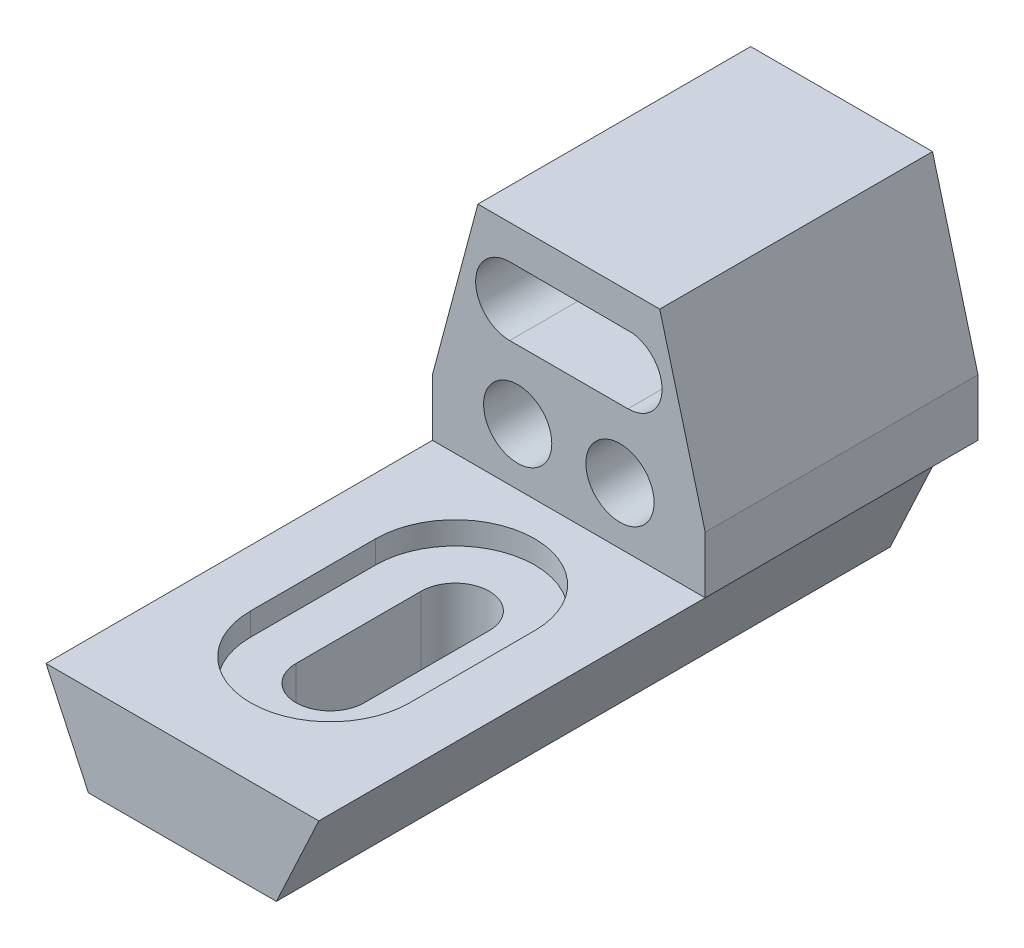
ISO-10303-21;
HEADER;
FILE_DESCRIPTION(('STEP AP214'),'2;1');
FILE_NAME('part.step','',(''),(''),'','','');
FILE_SCHEMA(('AUTOMOTIVE_DESIGN { 1 0 10303 214 1 1 1 1 }'));
ENDSEC;
DATA;
#1=APPLICATION_CONTEXT('core data for automotive mechanical design processes');
#2=APPLICATION_PROTOCOL_DEFINITION('international standard','automotive_design',2000,#1);
#3=PRODUCT_CONTEXT('',#1,'mechanical');
#4=PRODUCT('Part','Part','',(#3));
#5=PRODUCT_RELATED_PRODUCT_CATEGORY('part','',(#4));
#6=PRODUCT_DEFINITION_FORMATION('','',#4);
#7=PRODUCT_DEFINITION_CONTEXT('part definition',#1,'design');
#8=PRODUCT_DEFINITION('design','',#6,#7);
#9=PRODUCT_DEFINITION_SHAPE('','',#8);
#10=(LENGTH_UNIT() NAMED_UNIT(*) SI_UNIT(.MILLI.,.METRE.));
#11=(NAMED_UNIT(*) PLANE_ANGLE_UNIT() SI_UNIT($,.RADIAN.));
#12=(NAMED_UNIT(*) SI_UNIT($,.STERADIAN.) SOLID_ANGLE_UNIT());
#13=UNCERTAINTY_MEASURE_WITH_UNIT(LENGTH_MEASURE(1.E-05),#10,'distance_accuracy_value','');
#14=(GEOMETRIC_REPRESENTATION_CONTEXT(3) GLOBAL_UNCERTAINTY_ASSIGNED_CONTEXT((#13)) GLOBAL_UNIT_ASSIGNED_CONTEXT((#10,
#11,#12)) REPRESENTATION_CONTEXT('',''));
#15=CARTESIAN_POINT('',(0.,0.,0.));
#16=DIRECTION('',(0.,0.,1.));
#17=DIRECTION('',(1.,0.,0.));
#18=AXIS2_PLACEMENT_3D('',#15,#16,#17);
#19=CARTESIAN_POINT('',(0.,0.,-7366.));
#20=DIRECTION('',(0.,0.,1.));
#21=DIRECTION('',(1.,0.,0.));
#22=AXIS2_PLACEMENT_3D('',#19,#20,#21);
#23=PLANE('',#22);
#24=CARTESIAN_POINT('',(2095.5,635.,-7366.));
#25=DIRECTION('',(0.,0.,1.));
#26=DIRECTION('',(1.,0.,0.));
#27=AXIS2_PLACEMENT_3D('',#24,#25,#26);
#28=CIRCLE('',#27,381.);
#29=CARTESIAN_POINT('',(2476.5,635.,-7366.));
#30=VERTEX_POINT('',#29);
#31=EDGE_CURVE('E511',#30,#30,#28,.F.);
#32=ORIENTED_EDGE('',*,*,#31,.F.);
#33=EDGE_LOOP('',(#32));
#34=FACE_BOUND('',#33,.T.);
#35=CARTESIAN_POINT('',(952.5,635.,-7366.));
#36=DIRECTION('',(0.,0.,1.));
#37=DIRECTION('',(1.,0.,0.));
#38=AXIS2_PLACEMENT_3D('',#35,#36,#37);
#39=CIRCLE('',#38,381.);
#40=CARTESIAN_POINT('',(1333.5,635.,-7366.));
#41=VERTEX_POINT('',#40);
#42=EDGE_CURVE('E505',#41,#41,#39,.T.);
#43=ORIENTED_EDGE('',*,*,#42,.T.);
#44=EDGE_LOOP('',(#43));
#45=FACE_BOUND('',#44,.T.);
#46=DIRECTION('',(1.,0.,0.));
#47=VECTOR('',#46,1.);
#48=CARTESIAN_POINT('',(0.,0.,-7366.));
#49=LINE('',#48,#47);
#50=CARTESIAN_POINT('',(0.,0.,-7366.));
#51=VERTEX_POINT('',#50);
#52=CARTESIAN_POINT('',(3048.,0.,-7366.));
#53=VERTEX_POINT('',#52);
#54=EDGE_CURVE('E221',#51,#53,#49,.T.);
#55=ORIENTED_EDGE('',*,*,#54,.F.);
#56=DIRECTION('',(0.,-1.,0.));
#57=VECTOR('',#56,1.);
#58=CARTESIAN_POINT('',(0.,0.,-7366.));
#59=LINE('',#58,#57);
#60=CARTESIAN_POINT('',(0.,635.,-7366.));
#61=VERTEX_POINT('',#60);
#62=EDGE_CURVE('E289',#61,#51,#59,.T.);
#63=ORIENTED_EDGE('',*,*,#62,.F.);
#64=DIRECTION('',(-0.257662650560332,-0.966234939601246,0.));
#65=VECTOR('',#64,1.);
#66=CARTESIAN_POINT('',(0.,635.,-7366.));
#67=LINE('',#66,#65);
#68=CARTESIAN_POINT('',(508.,2540.,-7366.));
#69=VERTEX_POINT('',#68);
#70=EDGE_CURVE('E478',#69,#61,#67,.T.);
#71=ORIENTED_EDGE('',*,*,#70,.F.);
#72=DIRECTION('',(-1.,0.,0.));
#73=VECTOR('',#72,1.);
#74=CARTESIAN_POINT('',(1524.,2540.,-7366.));
#75=LINE('',#74,#73);
#76=CARTESIAN_POINT('',(2540.,2540.,-7366.));
#77=VERTEX_POINT('',#76);
#78=EDGE_CURVE('E473',#77,#69,#75,.T.);
#79=ORIENTED_EDGE('',*,*,#78,.F.);
#80=DIRECTION('',(-0.257662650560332,0.966234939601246,0.));
#81=VECTOR('',#80,1.);
#82=CARTESIAN_POINT('',(2540.,2540.,-7366.));
#83=LINE('',#82,#81);
#84=CARTESIAN_POINT('',(3048.,635.,-7366.));
#85=VERTEX_POINT('',#84);
#86=EDGE_CURVE('E471',#85,#77,#83,.T.);
#87=ORIENTED_EDGE('',*,*,#86,.F.);
#88=DIRECTION('',(0.,1.,0.));
#89=VECTOR('',#88,1.);
#90=CARTESIAN_POINT('',(3048.,0.,-7366.));
#91=LINE('',#90,#89);
#92=EDGE_CURVE('E224',#53,#85,#91,.T.);
#93=ORIENTED_EDGE('',*,*,#92,.F.);
#94=EDGE_LOOP('',(#55,#63,#71,#79,#87,#93));
#95=FACE_BOUND('',#94,.T.);
#96=CARTESIAN_POINT('',(863.6,1778.,-7366.));
#97=DIRECTION('',(0.,0.,1.));
#98=DIRECTION('',(1.,0.,0.));
#99=AXIS2_PLACEMENT_3D('',#96,#97,#98);
#100=CIRCLE('',#99,381.);
#101=CARTESIAN_POINT('',(863.6,1397.,-7366.));
#102=VERTEX_POINT('',#101);
#103=CARTESIAN_POINT('',(863.59999999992,2159.,-7366.));
#104=VERTEX_POINT('',#103);
#105=EDGE_CURVE('E37',#102,#104,#100,.F.);
#106=ORIENTED_EDGE('',*,*,#105,.F.);
#107=DIRECTION('',(1.,0.,0.));
#108=VECTOR('',#107,1.);
#109=CARTESIAN_POINT('',(0.,1397.,-7366.));
#110=LINE('',#109,#108);
#111=CARTESIAN_POINT('',(2184.4,1397.,-7366.));
#112=VERTEX_POINT('',#111);
#113=EDGE_CURVE('E487',#102,#112,#110,.T.);
#114=ORIENTED_EDGE('',*,*,#113,.T.);
#115=CARTESIAN_POINT('',(2184.4,1778.,-7366.));
#116=DIRECTION('',(0.,0.,1.));
#117=DIRECTION('',(1.,0.,0.));
#118=AXIS2_PLACEMENT_3D('',#115,#116,#117);
#119=CIRCLE('',#118,381.);
#120=CARTESIAN_POINT('',(2240.32346850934,2154.87340801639,-7366.));
#121=VERTEX_POINT('',#120);
#122=EDGE_CURVE('E52',#112,#121,#119,.T.);
#123=ORIENTED_EDGE('',*,*,#122,.T.);
#124=DIRECTION('',(0.999995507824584,-0.00299738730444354,0.));
#125=VECTOR('',#124,1.);
#126=CARTESIAN_POINT('',(6.47908898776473,2161.56913487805,-7366.));
#127=LINE('',#126,#125);
#128=EDGE_CURVE('E548',#104,#121,#127,.T.);
#129=ORIENTED_EDGE('',*,*,#128,.F.);
#130=EDGE_LOOP('',(#106,#114,#123,#129));
#131=FACE_BOUND('',#130,.T.);
#132=ADVANCED_FACE('F33',(#34,#45,#95,#131),#23,.F.);
#133=CARTESIAN_POINT('',(0.,0.,-4318.));
#134=DIRECTION('',(0.,0.,1.));
#135=DIRECTION('',(1.,0.,0.));
#136=AXIS2_PLACEMENT_3D('',#133,#134,#135);
#137=PLANE('',#136);
#138=CARTESIAN_POINT('',(2095.5,635.,-4318.));
#139=DIRECTION('',(0.,0.,1.));
#140=DIRECTION('',(1.,0.,0.));
#141=AXIS2_PLACEMENT_3D('',#138,#139,#140);
#142=CIRCLE('',#141,381.);
#143=CARTESIAN_POINT('',(2476.5,635.,-4318.));
#144=VERTEX_POINT('',#143);
#145=EDGE_CURVE('E514',#144,#144,#142,.F.);
#146=ORIENTED_EDGE('',*,*,#145,.T.);
#147=EDGE_LOOP('',(#146));
#148=FACE_BOUND('',#147,.T.);
#149=CARTESIAN_POINT('',(952.5,635.,-4318.));
#150=DIRECTION('',(0.,0.,1.));
#151=DIRECTION('',(1.,0.,0.));
#152=AXIS2_PLACEMENT_3D('',#149,#150,#151);
#153=CIRCLE('',#152,381.);
#154=CARTESIAN_POINT('',(1333.5,635.,-4318.));
#155=VERTEX_POINT('',#154);
#156=EDGE_CURVE('E508',#155,#155,#153,.T.);
#157=ORIENTED_EDGE('',*,*,#156,.F.);
#158=EDGE_LOOP('',(#157));
#159=FACE_BOUND('',#158,.T.);
#160=DIRECTION('',(1.,0.,0.));
#161=VECTOR('',#160,1.);
#162=CARTESIAN_POINT('',(0.,0.,-4318.));
#163=LINE('',#162,#161);
#164=CARTESIAN_POINT('',(0.,0.,-4318.));
#165=VERTEX_POINT('',#164);
#166=CARTESIAN_POINT('',(3048.,0.,-4318.));
#167=VERTEX_POINT('',#166);
#168=EDGE_CURVE('E187',#165,#167,#163,.T.);
#169=ORIENTED_EDGE('',*,*,#168,.T.);
#170=DIRECTION('',(0.,1.,0.));
#171=VECTOR('',#170,1.);
#172=CARTESIAN_POINT('',(3048.,0.,-4318.));
#173=LINE('',#172,#171);
#174=CARTESIAN_POINT('',(3048.,635.,-4318.));
#175=VERTEX_POINT('',#174);
#176=EDGE_CURVE('E198',#167,#175,#173,.T.);
#177=ORIENTED_EDGE('',*,*,#176,.T.);
#178=DIRECTION('',(-0.257662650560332,0.966234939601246,0.));
#179=VECTOR('',#178,1.);
#180=CARTESIAN_POINT('',(2540.,2540.,-4318.));
#181=LINE('',#180,#179);
#182=CARTESIAN_POINT('',(2540.,2540.,-4318.));
#183=VERTEX_POINT('',#182);
#184=EDGE_CURVE('E266',#175,#183,#181,.T.);
#185=ORIENTED_EDGE('',*,*,#184,.T.);
#186=DIRECTION('',(-1.,0.,0.));
#187=VECTOR('',#186,1.);
#188=CARTESIAN_POINT('',(1524.,2540.,-4318.));
#189=LINE('',#188,#187);
#190=CARTESIAN_POINT('',(508.,2540.,-4318.));
#191=VERTEX_POINT('',#190);
#192=EDGE_CURVE('E226',#183,#191,#189,.T.);
#193=ORIENTED_EDGE('',*,*,#192,.T.);
#194=DIRECTION('',(-0.257662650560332,-0.966234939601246,0.));
#195=VECTOR('',#194,1.);
#196=CARTESIAN_POINT('',(0.,635.,-4318.));
#197=LINE('',#196,#195);
#198=CARTESIAN_POINT('',(0.,635.,-4318.));
#199=VERTEX_POINT('',#198);
#200=EDGE_CURVE('E220',#191,#199,#197,.T.);
#201=ORIENTED_EDGE('',*,*,#200,.T.);
#202=DIRECTION('',(0.,-1.,0.));
#203=VECTOR('',#202,1.);
#204=CARTESIAN_POINT('',(0.,0.,-4318.));
#205=LINE('',#204,#203);
#206=EDGE_CURVE('E212',#199,#165,#205,.T.);
#207=ORIENTED_EDGE('',*,*,#206,.T.);
#208=EDGE_LOOP('',(#169,#177,#185,#193,#201,#207));
#209=FACE_BOUND('',#208,.T.);
#210=DIRECTION('',(1.,0.,0.));
#211=VECTOR('',#210,1.);
#212=CARTESIAN_POINT('',(0.,1397.,-4318.));
#213=LINE('',#212,#211);
#214=CARTESIAN_POINT('',(863.6,1397.,-4318.));
#215=VERTEX_POINT('',#214);
#216=CARTESIAN_POINT('',(2184.4,1397.,-4318.));
#217=VERTEX_POINT('',#216);
#218=EDGE_CURVE('E499',#215,#217,#213,.T.);
#219=ORIENTED_EDGE('',*,*,#218,.F.);
#220=CARTESIAN_POINT('',(863.6,1778.,-4318.));
#221=DIRECTION('',(0.,0.,1.));
#222=DIRECTION('',(1.,0.,0.));
#223=AXIS2_PLACEMENT_3D('',#220,#221,#222);
#224=CIRCLE('',#223,381.);
#225=CARTESIAN_POINT('',(863.6,2159.,-4318.));
#226=VERTEX_POINT('',#225);
#227=EDGE_CURVE('E502',#215,#226,#224,.F.);
#228=ORIENTED_EDGE('',*,*,#227,.T.);
#229=DIRECTION('',(0.999995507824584,-0.00299738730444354,0.));
#230=VECTOR('',#229,1.);
#231=CARTESIAN_POINT('',(6.47908898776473,2161.56913487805,-4318.));
#232=LINE('',#231,#230);
#233=CARTESIAN_POINT('',(2240.32346850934,2154.87340801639,-4318.));
#234=VERTEX_POINT('',#233);
#235=EDGE_CURVE('E492',#226,#234,#232,.T.);
#236=ORIENTED_EDGE('',*,*,#235,.T.);
#237=CARTESIAN_POINT('',(2184.4,1778.,-4318.));
#238=DIRECTION('',(0.,0.,1.));
#239=DIRECTION('',(1.,0.,0.));
#240=AXIS2_PLACEMENT_3D('',#237,#238,#239);
#241=CIRCLE('',#240,381.);
#242=EDGE_CURVE('E496',#217,#234,#241,.T.);
#243=ORIENTED_EDGE('',*,*,#242,.F.);
#244=EDGE_LOOP('',(#219,#228,#236,#243));
#245=FACE_BOUND('',#244,.T.);
#246=ADVANCED_FACE('F216',(#148,#159,#209,#245),#137,.T.);
#247=CARTESIAN_POINT('',(473.768580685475,-1016.,-6858.));
#248=DIRECTION('',(-0.906307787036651,-0.422618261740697,0.));
#249=DIRECTION('',(0.422618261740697,-0.906307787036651,0.));
#250=AXIS2_PLACEMENT_3D('',#247,#248,#249);
#251=PLANE('',#250);
#252=DIRECTION('',(0.422618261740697,-0.906307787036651,0.));
#253=VECTOR('',#252,1.);
#254=CARTESIAN_POINT('',(473.768580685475,-1016.,0.));
#255=LINE('',#254,#253);
#256=CARTESIAN_POINT('',(0.,0.,0.));
#257=VERTEX_POINT('',#256);
#258=CARTESIAN_POINT('',(473.768580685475,-1016.,0.));
#259=VERTEX_POINT('',#258);
#260=EDGE_CURVE('E204',#257,#259,#255,.T.);
#261=ORIENTED_EDGE('',*,*,#260,.F.);
#262=DIRECTION('',(0.,0.,1.));
#263=VECTOR('',#262,1.);
#264=CARTESIAN_POINT('',(0.,0.,-6858.));
#265=LINE('',#264,#263);
#266=EDGE_CURVE('E43',#165,#257,#265,.T.);
#267=ORIENTED_EDGE('',*,*,#266,.F.);
#268=CARTESIAN_POINT('',(0.,0.,-6858.));
#269=VERTEX_POINT('',#268);
#270=EDGE_CURVE('E11',#269,#165,#265,.T.);
#271=ORIENTED_EDGE('',*,*,#270,.F.);
#272=DIRECTION('',(0.422618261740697,-0.906307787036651,0.));
#273=VECTOR('',#272,1.);
#274=CARTESIAN_POINT('',(473.768580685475,-1016.,-6858.));
#275=LINE('',#274,#273);
#276=CARTESIAN_POINT('',(473.768580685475,-1016.,-6858.));
#277=VERTEX_POINT('',#276);
#278=EDGE_CURVE('E233',#269,#277,#275,.T.);
#279=ORIENTED_EDGE('',*,*,#278,.T.);
#280=DIRECTION('',(0.,0.,1.));
#281=VECTOR('',#280,1.);
#282=CARTESIAN_POINT('',(473.768580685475,-1016.,-6858.));
#283=LINE('',#282,#281);
#284=EDGE_CURVE('E243',#277,#259,#283,.T.);
#285=ORIENTED_EDGE('',*,*,#284,.T.);
#286=EDGE_LOOP('',(#261,#267,#271,#279,#285));
#287=FACE_BOUND('',#286,.T.);
#288=ADVANCED_FACE('F35',(#287),#251,.T.);
#289=CARTESIAN_POINT('',(0.,0.,-6858.));
#290=DIRECTION('',(0.,1.,0.));
#291=DIRECTION('',(0.,0.,1.));
#292=AXIS2_PLACEMENT_3D('',#289,#290,#291);
#293=PLANE('',#292);
#294=ORIENTED_EDGE('',*,*,#168,.F.);
#295=ORIENTED_EDGE('',*,*,#266,.T.);
#296=DIRECTION('',(-1.,0.,0.));
#297=VECTOR('',#296,1.);
#298=CARTESIAN_POINT('',(0.,0.,0.));
#299=LINE('',#298,#297);
#300=CARTESIAN_POINT('',(3048.,0.,0.));
#301=VERTEX_POINT('',#300);
#302=EDGE_CURVE('E236',#301,#257,#299,.T.);
#303=ORIENTED_EDGE('',*,*,#302,.F.);
#304=DIRECTION('',(0.,0.,1.));
#305=VECTOR('',#304,1.);
#306=CARTESIAN_POINT('',(3048.,0.,-6858.));
#307=LINE('',#306,#305);
#308=EDGE_CURVE('E193',#167,#301,#307,.T.);
#309=ORIENTED_EDGE('',*,*,#308,.F.);
#310=EDGE_LOOP('',(#294,#295,#303,#309));
#311=FACE_BOUND('',#310,.T.);
#312=CARTESIAN_POINT('',(1524.,0.,-3048.));
#313=DIRECTION('',(0.,1.,0.));
#314=DIRECTION('',(0.,0.,1.));
#315=AXIS2_PLACEMENT_3D('',#312,#313,#314);
#316=CIRCLE('',#315,889.000000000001);
#317=CARTESIAN_POINT('',(2413.,0.,-3048.));
#318=VERTEX_POINT('',#317);
#319=CARTESIAN_POINT('',(634.999999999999,0.,-3048.));
#320=VERTEX_POINT('',#319);
#321=EDGE_CURVE('E315',#318,#320,#316,.T.);
#322=ORIENTED_EDGE('',*,*,#321,.F.);
#323=DIRECTION('',(0.,0.,-1.));
#324=VECTOR('',#323,1.);
#325=CARTESIAN_POINT('',(2413.,0.,-3048.));
#326=LINE('',#325,#324);
#327=CARTESIAN_POINT('',(2413.,0.,-1651.));
#328=VERTEX_POINT('',#327);
#329=EDGE_CURVE('E326',#328,#318,#326,.T.);
#330=ORIENTED_EDGE('',*,*,#329,.F.);
#331=CARTESIAN_POINT('',(1524.,0.,-1651.));
#332=DIRECTION('',(0.,1.,0.));
#333=DIRECTION('',(0.,0.,1.));
#334=AXIS2_PLACEMENT_3D('',#331,#332,#333);
#335=CIRCLE('',#334,889.000000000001);
#336=CARTESIAN_POINT('',(634.999999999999,0.,-1651.));
#337=VERTEX_POINT('',#336);
#338=EDGE_CURVE('E340',#337,#328,#335,.T.);
#339=ORIENTED_EDGE('',*,*,#338,.F.);
#340=DIRECTION('',(0.,0.,1.));
#341=VECTOR('',#340,1.);
#342=CARTESIAN_POINT('',(634.999999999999,0.,-3048.));
#343=LINE('',#342,#341);
#344=EDGE_CURVE('E337',#320,#337,#343,.T.);
#345=ORIENTED_EDGE('',*,*,#344,.F.);
#346=EDGE_LOOP('',(#322,#330,#339,#345));
#347=FACE_BOUND('',#346,.T.);
#348=ADVANCED_FACE('F189',(#311,#347),#293,.T.);
#349=CARTESIAN_POINT('',(3048.,0.,-6858.));
#350=DIRECTION('',(0.906307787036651,-0.422618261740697,0.));
#351=DIRECTION('',(0.422618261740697,0.906307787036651,0.));
#352=AXIS2_PLACEMENT_3D('',#349,#350,#351);
#353=PLANE('',#352);
#354=DIRECTION('',(0.422618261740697,0.906307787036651,0.));
#355=VECTOR('',#354,1.);
#356=CARTESIAN_POINT('',(3048.,0.,0.));
#357=LINE('',#356,#355);
#358=CARTESIAN_POINT('',(2574.23141931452,-1016.,0.));
#359=VERTEX_POINT('',#358);
#360=EDGE_CURVE('E255',#359,#301,#357,.T.);
#361=ORIENTED_EDGE('',*,*,#360,.F.);
#362=DIRECTION('',(0.,0.,1.));
#363=VECTOR('',#362,1.);
#364=CARTESIAN_POINT('',(2574.23141931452,-1016.,-6858.));
#365=LINE('',#364,#363);
#366=CARTESIAN_POINT('',(2574.23141931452,-1016.,-6858.));
#367=VERTEX_POINT('',#366);
#368=EDGE_CURVE('E452',#367,#359,#365,.T.);
#369=ORIENTED_EDGE('',*,*,#368,.F.);
#370=DIRECTION('',(0.422618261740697,0.906307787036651,0.));
#371=VECTOR('',#370,1.);
#372=CARTESIAN_POINT('',(3048.,0.,-6858.));
#373=LINE('',#372,#371);
#374=CARTESIAN_POINT('',(3048.,0.,-6858.));
#375=VERTEX_POINT('',#374);
#376=EDGE_CURVE('E244',#367,#375,#373,.T.);
#377=ORIENTED_EDGE('',*,*,#376,.T.);
#378=EDGE_CURVE('E206',#375,#167,#307,.T.);
#379=ORIENTED_EDGE('',*,*,#378,.T.);
#380=ORIENTED_EDGE('',*,*,#308,.T.);
#381=EDGE_LOOP('',(#361,#369,#377,#379,#380));
#382=FACE_BOUND('',#381,.T.);
#383=ADVANCED_FACE('F448',(#382),#353,.T.);
#384=CARTESIAN_POINT('',(2574.23141931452,-1016.,-6858.));
#385=DIRECTION('',(0.,-1.,0.));
#386=DIRECTION('',(1.,0.,0.));
#387=AXIS2_PLACEMENT_3D('',#384,#385,#386);
#388=PLANE('',#387);
#389=CARTESIAN_POINT('',(1524.,-1016.,-3048.));
#390=DIRECTION('',(0.,1.,0.));
#391=DIRECTION('',(0.,0.,1.));
#392=AXIS2_PLACEMENT_3D('',#389,#390,#391);
#393=CIRCLE('',#392,381.);
#394=CARTESIAN_POINT('',(1905.,-1016.,-3048.));
#395=VERTEX_POINT('',#394);
#396=CARTESIAN_POINT('',(1143.,-1016.,-3048.));
#397=VERTEX_POINT('',#396);
#398=EDGE_CURVE('E290',#395,#397,#393,.T.);
#399=ORIENTED_EDGE('',*,*,#398,.T.);
#400=DIRECTION('',(0.,0.,1.));
#401=VECTOR('',#400,1.);
#402=CARTESIAN_POINT('',(1143.,-1016.,-3048.));
#403=LINE('',#402,#401);
#404=CARTESIAN_POINT('',(1143.,-1016.,-1651.));
#405=VERTEX_POINT('',#404);
#406=EDGE_CURVE('E293',#397,#405,#403,.T.);
#407=ORIENTED_EDGE('',*,*,#406,.T.);
#408=CARTESIAN_POINT('',(1524.,-1016.,-1651.));
#409=DIRECTION('',(0.,1.,0.));
#410=DIRECTION('',(0.,0.,1.));
#411=AXIS2_PLACEMENT_3D('',#408,#409,#410);
#412=CIRCLE('',#411,381.);
#413=CARTESIAN_POINT('',(1905.,-1016.,-1651.));
#414=VERTEX_POINT('',#413);
#415=EDGE_CURVE('E297',#405,#414,#412,.T.);
#416=ORIENTED_EDGE('',*,*,#415,.T.);
#417=DIRECTION('',(0.,0.,-1.));
#418=VECTOR('',#417,1.);
#419=CARTESIAN_POINT('',(1905.,-1016.,-3048.));
#420=LINE('',#419,#418);
#421=EDGE_CURVE('E300',#414,#395,#420,.T.);
#422=ORIENTED_EDGE('',*,*,#421,.T.);
#423=EDGE_LOOP('',(#399,#407,#416,#422));
#424=FACE_BOUND('',#423,.T.);
#425=DIRECTION('',(1.,0.,0.));
#426=VECTOR('',#425,1.);
#427=CARTESIAN_POINT('',(2574.23141931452,-1016.,0.));
#428=LINE('',#427,#426);
#429=EDGE_CURVE('E251',#259,#359,#428,.T.);
#430=ORIENTED_EDGE('',*,*,#429,.F.);
#431=ORIENTED_EDGE('',*,*,#284,.F.);
#432=DIRECTION('',(1.,0.,0.));
#433=VECTOR('',#432,1.);
#434=CARTESIAN_POINT('',(2574.23141931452,-1016.,-6858.));
#435=LINE('',#434,#433);
#436=EDGE_CURVE('E235',#277,#367,#435,.T.);
#437=ORIENTED_EDGE('',*,*,#436,.T.);
#438=ORIENTED_EDGE('',*,*,#368,.T.);
#439=EDGE_LOOP('',(#430,#431,#437,#438));
#440=FACE_BOUND('',#439,.T.);
#441=ADVANCED_FACE('F443',(#424,#440),#388,.T.);
#442=CARTESIAN_POINT('',(0.,0.,-6858.));
#443=DIRECTION('',(0.,0.,-1.));
#444=DIRECTION('',(-1.,0.,0.));
#445=AXIS2_PLACEMENT_3D('',#442,#443,#444);
#446=PLANE('',#445);
#447=ORIENTED_EDGE('',*,*,#278,.F.);
#448=DIRECTION('',(-1.,0.,0.));
#449=VECTOR('',#448,1.);
#450=CARTESIAN_POINT('',(0.,0.,-6858.));
#451=LINE('',#450,#449);
#452=EDGE_CURVE('E239',#375,#269,#451,.T.);
#453=ORIENTED_EDGE('',*,*,#452,.F.);
#454=ORIENTED_EDGE('',*,*,#376,.F.);
#455=ORIENTED_EDGE('',*,*,#436,.F.);
#456=EDGE_LOOP('',(#447,#453,#454,#455));
#457=FACE_BOUND('',#456,.T.);
#458=ADVANCED_FACE('F447',(#457),#446,.T.);
#459=CARTESIAN_POINT('',(0.,0.,0.));
#460=DIRECTION('',(0.,0.,-1.));
#461=DIRECTION('',(-1.,0.,0.));
#462=AXIS2_PLACEMENT_3D('',#459,#460,#461);
#463=PLANE('',#462);
#464=ORIENTED_EDGE('',*,*,#260,.T.);
#465=ORIENTED_EDGE('',*,*,#429,.T.);
#466=ORIENTED_EDGE('',*,*,#360,.T.);
#467=ORIENTED_EDGE('',*,*,#302,.T.);
#468=EDGE_LOOP('',(#464,#465,#466,#467));
#469=FACE_BOUND('',#468,.T.);
#470=ADVANCED_FACE('F375',(#469),#463,.F.);
#471=CARTESIAN_POINT('',(1524.,-254.,-3048.));
#472=DIRECTION('',(0.,1.,0.));
#473=DIRECTION('',(0.,0.,1.));
#474=AXIS2_PLACEMENT_3D('',#471,#472,#473);
#475=CYLINDRICAL_SURFACE('',#474,889.000000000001);
#476=ORIENTED_EDGE('',*,*,#321,.T.);
#477=DIRECTION('',(0.,1.,0.));
#478=VECTOR('',#477,1.);
#479=CARTESIAN_POINT('',(634.999999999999,-254.,-3048.));
#480=LINE('',#479,#478);
#481=CARTESIAN_POINT('',(634.999999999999,-254.,-3048.));
#482=VERTEX_POINT('',#481);
#483=EDGE_CURVE('E335',#482,#320,#480,.T.);
#484=ORIENTED_EDGE('',*,*,#483,.F.);
#485=CARTESIAN_POINT('',(1524.,-254.,-3048.));
#486=DIRECTION('',(0.,1.,0.));
#487=DIRECTION('',(0.,0.,1.));
#488=AXIS2_PLACEMENT_3D('',#485,#486,#487);
#489=CIRCLE('',#488,889.000000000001);
#490=CARTESIAN_POINT('',(2413.,-254.,-3048.));
#491=VERTEX_POINT('',#490);
#492=EDGE_CURVE('E322',#491,#482,#489,.T.);
#493=ORIENTED_EDGE('',*,*,#492,.F.);
#494=DIRECTION('',(0.,1.,0.));
#495=VECTOR('',#494,1.);
#496=CARTESIAN_POINT('',(2413.,-254.,-3048.));
#497=LINE('',#496,#495);
#498=EDGE_CURVE('E252',#491,#318,#497,.T.);
#499=ORIENTED_EDGE('',*,*,#498,.T.);
#500=EDGE_LOOP('',(#476,#484,#493,#499));
#501=FACE_BOUND('',#500,.T.);
#502=ADVANCED_FACE('F365',(#501),#475,.F.);
#503=CARTESIAN_POINT('',(2413.,-254.,-3048.));
#504=DIRECTION('',(1.,0.,0.));
#505=DIRECTION('',(0.,0.,-1.));
#506=AXIS2_PLACEMENT_3D('',#503,#504,#505);
#507=PLANE('',#506);
#508=ORIENTED_EDGE('',*,*,#329,.T.);
#509=ORIENTED_EDGE('',*,*,#498,.F.);
#510=DIRECTION('',(0.,0.,-1.));
#511=VECTOR('',#510,1.);
#512=CARTESIAN_POINT('',(2413.,-254.,-3048.));
#513=LINE('',#512,#511);
#514=CARTESIAN_POINT('',(2413.,-254.,-1651.));
#515=VERTEX_POINT('',#514);
#516=EDGE_CURVE('E332',#515,#491,#513,.T.);
#517=ORIENTED_EDGE('',*,*,#516,.F.);
#518=DIRECTION('',(0.,1.,0.));
#519=VECTOR('',#518,1.);
#520=CARTESIAN_POINT('',(2413.,-254.,-1651.));
#521=LINE('',#520,#519);
#522=EDGE_CURVE('E346',#515,#328,#521,.T.);
#523=ORIENTED_EDGE('',*,*,#522,.T.);
#524=EDGE_LOOP('',(#508,#509,#517,#523));
#525=FACE_BOUND('',#524,.T.);
#526=ADVANCED_FACE('F367',(#525),#507,.F.);
#527=CARTESIAN_POINT('',(1524.,-254.,-1651.));
#528=DIRECTION('',(0.,1.,0.));
#529=DIRECTION('',(0.,0.,1.));
#530=AXIS2_PLACEMENT_3D('',#527,#528,#529);
#531=CYLINDRICAL_SURFACE('',#530,889.000000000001);
#532=ORIENTED_EDGE('',*,*,#338,.T.);
#533=ORIENTED_EDGE('',*,*,#522,.F.);
#534=CARTESIAN_POINT('',(1524.,-254.,-1651.));
#535=DIRECTION('',(0.,1.,0.));
#536=DIRECTION('',(0.,0.,1.));
#537=AXIS2_PLACEMENT_3D('',#534,#535,#536);
#538=CIRCLE('',#537,889.000000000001);
#539=CARTESIAN_POINT('',(634.999999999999,-254.,-1651.));
#540=VERTEX_POINT('',#539);
#541=EDGE_CURVE('E329',#540,#515,#538,.T.);
#542=ORIENTED_EDGE('',*,*,#541,.F.);
#543=DIRECTION('',(0.,1.,0.));
#544=VECTOR('',#543,1.);
#545=CARTESIAN_POINT('',(634.999999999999,-254.,-1651.));
#546=LINE('',#545,#544);
#547=EDGE_CURVE('E348',#540,#337,#546,.T.);
#548=ORIENTED_EDGE('',*,*,#547,.T.);
#549=EDGE_LOOP('',(#532,#533,#542,#548));
#550=FACE_BOUND('',#549,.T.);
#551=ADVANCED_FACE('F360',(#550),#531,.F.);
#552=CARTESIAN_POINT('',(634.999999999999,-254.,-3048.));
#553=DIRECTION('',(-1.,0.,0.));
#554=DIRECTION('',(0.,0.,1.));
#555=AXIS2_PLACEMENT_3D('',#552,#553,#554);
#556=PLANE('',#555);
#557=ORIENTED_EDGE('',*,*,#344,.T.);
#558=ORIENTED_EDGE('',*,*,#547,.F.);
#559=DIRECTION('',(0.,0.,1.));
#560=VECTOR('',#559,1.);
#561=CARTESIAN_POINT('',(634.999999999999,-254.,-3048.));
#562=LINE('',#561,#560);
#563=EDGE_CURVE('E325',#482,#540,#562,.T.);
#564=ORIENTED_EDGE('',*,*,#563,.F.);
#565=ORIENTED_EDGE('',*,*,#483,.T.);
#566=EDGE_LOOP('',(#557,#558,#564,#565));
#567=FACE_BOUND('',#566,.T.);
#568=ADVANCED_FACE('F353',(#567),#556,.F.);
#569=CARTESIAN_POINT('',(1524.,-254.,-3048.));
#570=DIRECTION('',(0.,1.,0.));
#571=DIRECTION('',(0.,0.,1.));
#572=AXIS2_PLACEMENT_3D('',#569,#570,#571);
#573=PLANE('',#572);
#574=CARTESIAN_POINT('',(1524.,-254.,-3048.));
#575=DIRECTION('',(0.,1.,0.));
#576=DIRECTION('',(0.,0.,1.));
#577=AXIS2_PLACEMENT_3D('',#574,#575,#576);
#578=CIRCLE('',#577,381.);
#579=CARTESIAN_POINT('',(1905.,-254.,-3048.));
#580=VERTEX_POINT('',#579);
#581=CARTESIAN_POINT('',(1143.,-254.,-3048.));
#582=VERTEX_POINT('',#581);
#583=EDGE_CURVE('E282',#580,#582,#578,.T.);
#584=ORIENTED_EDGE('',*,*,#583,.F.);
#585=DIRECTION('',(0.,0.,-1.));
#586=VECTOR('',#585,1.);
#587=CARTESIAN_POINT('',(1905.,-254.,-3048.));
#588=LINE('',#587,#586);
#589=CARTESIAN_POINT('',(1905.,-254.,-1651.));
#590=VERTEX_POINT('',#589);
#591=EDGE_CURVE('E294',#590,#580,#588,.T.);
#592=ORIENTED_EDGE('',*,*,#591,.F.);
#593=CARTESIAN_POINT('',(1524.,-254.,-1651.));
#594=DIRECTION('',(0.,1.,0.));
#595=DIRECTION('',(0.,0.,1.));
#596=AXIS2_PLACEMENT_3D('',#593,#594,#595);
#597=CIRCLE('',#596,381.);
#598=CARTESIAN_POINT('',(1143.,-254.,-1651.));
#599=VERTEX_POINT('',#598);
#600=EDGE_CURVE('E308',#599,#590,#597,.T.);
#601=ORIENTED_EDGE('',*,*,#600,.F.);
#602=DIRECTION('',(0.,0.,1.));
#603=VECTOR('',#602,1.);
#604=CARTESIAN_POINT('',(1143.,-254.,-3048.));
#605=LINE('',#604,#603);
#606=EDGE_CURVE('E305',#582,#599,#605,.T.);
#607=ORIENTED_EDGE('',*,*,#606,.F.);
#608=EDGE_LOOP('',(#584,#592,#601,#607));
#609=FACE_BOUND('',#608,.T.);
#610=ORIENTED_EDGE('',*,*,#492,.T.);
#611=ORIENTED_EDGE('',*,*,#563,.T.);
#612=ORIENTED_EDGE('',*,*,#541,.T.);
#613=ORIENTED_EDGE('',*,*,#516,.T.);
#614=EDGE_LOOP('',(#610,#611,#612,#613));
#615=FACE_BOUND('',#614,.T.);
#616=ADVANCED_FACE('F364',(#609,#615),#573,.T.);
#617=CARTESIAN_POINT('',(1524.,-1016.,-3048.));
#618=DIRECTION('',(0.,1.,0.));
#619=DIRECTION('',(0.,0.,1.));
#620=AXIS2_PLACEMENT_3D('',#617,#618,#619);
#621=CYLINDRICAL_SURFACE('',#620,381.);
#622=ORIENTED_EDGE('',*,*,#583,.T.);
#623=DIRECTION('',(0.,1.,0.));
#624=VECTOR('',#623,1.);
#625=CARTESIAN_POINT('',(1143.,-1016.,-3048.));
#626=LINE('',#625,#624);
#627=EDGE_CURVE('E303',#397,#582,#626,.T.);
#628=ORIENTED_EDGE('',*,*,#627,.F.);
#629=ORIENTED_EDGE('',*,*,#398,.F.);
#630=DIRECTION('',(0.,1.,0.));
#631=VECTOR('',#630,1.);
#632=CARTESIAN_POINT('',(1905.,-1016.,-3048.));
#633=LINE('',#632,#631);
#634=EDGE_CURVE('E313',#395,#580,#633,.T.);
#635=ORIENTED_EDGE('',*,*,#634,.T.);
#636=EDGE_LOOP('',(#622,#628,#629,#635));
#637=FACE_BOUND('',#636,.T.);
#638=ADVANCED_FACE('F419',(#637),#621,.F.);
#639=CARTESIAN_POINT('',(1905.,-1016.,-3048.));
#640=DIRECTION('',(1.,0.,0.));
#641=DIRECTION('',(0.,0.,-1.));
#642=AXIS2_PLACEMENT_3D('',#639,#640,#641);
#643=PLANE('',#642);
#644=ORIENTED_EDGE('',*,*,#591,.T.);
#645=ORIENTED_EDGE('',*,*,#634,.F.);
#646=ORIENTED_EDGE('',*,*,#421,.F.);
#647=DIRECTION('',(0.,1.,0.));
#648=VECTOR('',#647,1.);
#649=CARTESIAN_POINT('',(1905.,-1016.,-1651.));
#650=LINE('',#649,#648);
#651=EDGE_CURVE('E316',#414,#590,#650,.T.);
#652=ORIENTED_EDGE('',*,*,#651,.T.);
#653=EDGE_LOOP('',(#644,#645,#646,#652));
#654=FACE_BOUND('',#653,.T.);
#655=ADVANCED_FACE('F415',(#654),#643,.F.);
#656=CARTESIAN_POINT('',(1524.,-1016.,-1651.));
#657=DIRECTION('',(0.,1.,0.));
#658=DIRECTION('',(0.,0.,1.));
#659=AXIS2_PLACEMENT_3D('',#656,#657,#658);
#660=CYLINDRICAL_SURFACE('',#659,381.);
#661=ORIENTED_EDGE('',*,*,#600,.T.);
#662=ORIENTED_EDGE('',*,*,#651,.F.);
#663=ORIENTED_EDGE('',*,*,#415,.F.);
#664=DIRECTION('',(0.,1.,0.));
#665=VECTOR('',#664,1.);
#666=CARTESIAN_POINT('',(1143.,-1016.,-1651.));
#667=LINE('',#666,#665);
#668=EDGE_CURVE('E318',#405,#599,#667,.T.);
#669=ORIENTED_EDGE('',*,*,#668,.T.);
#670=EDGE_LOOP('',(#661,#662,#663,#669));
#671=FACE_BOUND('',#670,.T.);
#672=ADVANCED_FACE('F418',(#671),#660,.F.);
#673=CARTESIAN_POINT('',(1143.,-1016.,-3048.));
#674=DIRECTION('',(-1.,0.,0.));
#675=DIRECTION('',(0.,0.,1.));
#676=AXIS2_PLACEMENT_3D('',#673,#674,#675);
#677=PLANE('',#676);
#678=ORIENTED_EDGE('',*,*,#606,.T.);
#679=ORIENTED_EDGE('',*,*,#668,.F.);
#680=ORIENTED_EDGE('',*,*,#406,.F.);
#681=ORIENTED_EDGE('',*,*,#627,.T.);
#682=EDGE_LOOP('',(#678,#679,#680,#681));
#683=FACE_BOUND('',#682,.T.);
#684=ADVANCED_FACE('F413',(#683),#677,.F.);
#685=CARTESIAN_POINT('',(0.,0.,-7366.));
#686=DIRECTION('',(0.,-1.,0.));
#687=DIRECTION('',(0.,0.,-1.));
#688=AXIS2_PLACEMENT_3D('',#685,#686,#687);
#689=PLANE('',#688);
#690=DIRECTION('',(0.,0.,1.));
#691=VECTOR('',#690,1.);
#692=CARTESIAN_POINT('',(3048.,0.,-7366.));
#693=LINE('',#692,#691);
#694=EDGE_CURVE('E285',#53,#375,#693,.T.);
#695=ORIENTED_EDGE('',*,*,#694,.T.);
#696=ORIENTED_EDGE('',*,*,#452,.T.);
#697=DIRECTION('',(0.,0.,1.));
#698=VECTOR('',#697,1.);
#699=CARTESIAN_POINT('',(0.,0.,-7366.));
#700=LINE('',#699,#698);
#701=EDGE_CURVE('E214',#51,#269,#700,.T.);
#702=ORIENTED_EDGE('',*,*,#701,.F.);
#703=ORIENTED_EDGE('',*,*,#54,.T.);
#704=EDGE_LOOP('',(#695,#696,#702,#703));
#705=FACE_BOUND('',#704,.T.);
#706=ADVANCED_FACE('F395',(#705),#689,.T.);
#707=CARTESIAN_POINT('',(0.,0.,-7366.));
#708=DIRECTION('',(-1.,0.,0.));
#709=DIRECTION('',(0.,0.,1.));
#710=AXIS2_PLACEMENT_3D('',#707,#708,#709);
#711=PLANE('',#710);
#712=ORIENTED_EDGE('',*,*,#206,.F.);
#713=DIRECTION('',(0.,0.,1.));
#714=VECTOR('',#713,1.);
#715=CARTESIAN_POINT('',(0.,635.,-7366.));
#716=LINE('',#715,#714);
#717=EDGE_CURVE('E277',#61,#199,#716,.T.);
#718=ORIENTED_EDGE('',*,*,#717,.F.);
#719=ORIENTED_EDGE('',*,*,#62,.T.);
#720=ORIENTED_EDGE('',*,*,#701,.T.);
#721=ORIENTED_EDGE('',*,*,#270,.T.);
#722=EDGE_LOOP('',(#712,#718,#719,#720,#721));
#723=FACE_BOUND('',#722,.T.);
#724=ADVANCED_FACE('F211',(#723),#711,.T.);
#725=CARTESIAN_POINT('',(0.,635.,-7366.));
#726=DIRECTION('',(-0.966234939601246,0.257662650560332,0.));
#727=DIRECTION('',(-0.257662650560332,-0.966234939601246,0.));
#728=AXIS2_PLACEMENT_3D('',#725,#726,#727);
#729=PLANE('',#728);
#730=ORIENTED_EDGE('',*,*,#200,.F.);
#731=DIRECTION('',(0.,0.,1.));
#732=VECTOR('',#731,1.);
#733=CARTESIAN_POINT('',(508.,2540.,-7366.));
#734=LINE('',#733,#732);
#735=EDGE_CURVE('E482',#69,#191,#734,.T.);
#736=ORIENTED_EDGE('',*,*,#735,.F.);
#737=ORIENTED_EDGE('',*,*,#70,.T.);
#738=ORIENTED_EDGE('',*,*,#717,.T.);
#739=EDGE_LOOP('',(#730,#736,#737,#738));
#740=FACE_BOUND('',#739,.T.);
#741=ADVANCED_FACE('F394',(#740),#729,.T.);
#742=CARTESIAN_POINT('',(1524.,2540.,-7366.));
#743=DIRECTION('',(0.,1.,0.));
#744=DIRECTION('',(0.,0.,1.));
#745=AXIS2_PLACEMENT_3D('',#742,#743,#744);
#746=PLANE('',#745);
#747=ORIENTED_EDGE('',*,*,#192,.F.);
#748=DIRECTION('',(0.,0.,1.));
#749=VECTOR('',#748,1.);
#750=CARTESIAN_POINT('',(2540.,2540.,-7366.));
#751=LINE('',#750,#749);
#752=EDGE_CURVE('E483',#77,#183,#751,.T.);
#753=ORIENTED_EDGE('',*,*,#752,.F.);
#754=ORIENTED_EDGE('',*,*,#78,.T.);
#755=ORIENTED_EDGE('',*,*,#735,.T.);
#756=EDGE_LOOP('',(#747,#753,#754,#755));
#757=FACE_BOUND('',#756,.T.);
#758=ADVANCED_FACE('F398',(#757),#746,.T.);
#759=CARTESIAN_POINT('',(2540.,2540.,-7366.));
#760=DIRECTION('',(0.966234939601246,0.257662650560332,0.));
#761=DIRECTION('',(-0.257662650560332,0.966234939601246,0.));
#762=AXIS2_PLACEMENT_3D('',#759,#760,#761);
#763=PLANE('',#762);
#764=ORIENTED_EDGE('',*,*,#184,.F.);
#765=DIRECTION('',(0.,0.,1.));
#766=VECTOR('',#765,1.);
#767=CARTESIAN_POINT('',(3048.,635.,-7366.));
#768=LINE('',#767,#766);
#769=EDGE_CURVE('E288',#85,#175,#768,.T.);
#770=ORIENTED_EDGE('',*,*,#769,.F.);
#771=ORIENTED_EDGE('',*,*,#86,.T.);
#772=ORIENTED_EDGE('',*,*,#752,.T.);
#773=EDGE_LOOP('',(#764,#770,#771,#772));
#774=FACE_BOUND('',#773,.T.);
#775=ADVANCED_FACE('F402',(#774),#763,.T.);
#776=CARTESIAN_POINT('',(3048.,0.,-7366.));
#777=DIRECTION('',(1.,0.,0.));
#778=DIRECTION('',(0.,0.,-1.));
#779=AXIS2_PLACEMENT_3D('',#776,#777,#778);
#780=PLANE('',#779);
#781=ORIENTED_EDGE('',*,*,#176,.F.);
#782=ORIENTED_EDGE('',*,*,#378,.F.);
#783=ORIENTED_EDGE('',*,*,#694,.F.);
#784=ORIENTED_EDGE('',*,*,#92,.T.);
#785=ORIENTED_EDGE('',*,*,#769,.T.);
#786=EDGE_LOOP('',(#781,#782,#783,#784,#785));
#787=FACE_BOUND('',#786,.T.);
#788=ADVANCED_FACE('F406',(#787),#780,.T.);
#789=CARTESIAN_POINT('',(863.6,1778.,-7366.000025));
#790=DIRECTION('',(0.,0.,1.));
#791=DIRECTION('',(1.,0.,0.));
#792=AXIS2_PLACEMENT_3D('',#789,#790,#791);
#793=CYLINDRICAL_SURFACE('',#792,381.);
#794=ORIENTED_EDGE('',*,*,#105,.T.);
#795=DIRECTION('',(0.,0.,1.));
#796=VECTOR('',#795,1.);
#797=CARTESIAN_POINT('',(863.6,2159.,-7366.000025));
#798=LINE('',#797,#796);
#799=EDGE_CURVE('E72',#104,#226,#798,.T.);
#800=ORIENTED_EDGE('',*,*,#799,.T.);
#801=ORIENTED_EDGE('',*,*,#227,.F.);
#802=DIRECTION('',(0.,0.,1.));
#803=VECTOR('',#802,1.);
#804=CARTESIAN_POINT('',(863.6,1397.,-7366.000025));
#805=LINE('',#804,#803);
#806=EDGE_CURVE('E66',#102,#215,#805,.T.);
#807=ORIENTED_EDGE('',*,*,#806,.F.);
#808=EDGE_LOOP('',(#794,#800,#801,#807));
#809=FACE_BOUND('',#808,.T.);
#810=ADVANCED_FACE('F389',(#809),#793,.F.);
#811=CARTESIAN_POINT('',(6.47908898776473,2161.56913487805,-7366.000025));
#812=DIRECTION('',(-0.00299738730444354,-0.999995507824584,0.));
#813=DIRECTION('',(0.999995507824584,-0.00299738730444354,0.));
#814=AXIS2_PLACEMENT_3D('',#811,#812,#813);
#815=PLANE('',#814);
#816=ORIENTED_EDGE('',*,*,#128,.T.);
#817=DIRECTION('',(0.,0.,1.));
#818=VECTOR('',#817,1.);
#819=CARTESIAN_POINT('',(2240.32346850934,2154.87340801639,-7366.000025));
#820=LINE('',#819,#818);
#821=EDGE_CURVE('E488',#121,#234,#820,.T.);
#822=ORIENTED_EDGE('',*,*,#821,.T.);
#823=ORIENTED_EDGE('',*,*,#235,.F.);
#824=ORIENTED_EDGE('',*,*,#799,.F.);
#825=EDGE_LOOP('',(#816,#822,#823,#824));
#826=FACE_BOUND('',#825,.T.);
#827=ADVANCED_FACE('F531',(#826),#815,.T.);
#828=CARTESIAN_POINT('',(2184.4,1778.,-7366.000025));
#829=DIRECTION('',(0.,0.,1.));
#830=DIRECTION('',(1.,0.,0.));
#831=AXIS2_PLACEMENT_3D('',#828,#829,#830);
#832=CYLINDRICAL_SURFACE('',#831,381.);
#833=DIRECTION('',(0.,0.,1.));
#834=VECTOR('',#833,1.);
#835=CARTESIAN_POINT('',(2184.4,1397.,-7366.000025));
#836=LINE('',#835,#834);
#837=EDGE_CURVE('E490',#112,#217,#836,.T.);
#838=ORIENTED_EDGE('',*,*,#837,.T.);
#839=ORIENTED_EDGE('',*,*,#242,.T.);
#840=ORIENTED_EDGE('',*,*,#821,.F.);
#841=ORIENTED_EDGE('',*,*,#122,.F.);
#842=EDGE_LOOP('',(#838,#839,#840,#841));
#843=FACE_BOUND('',#842,.T.);
#844=ADVANCED_FACE('F534',(#843),#832,.F.);
#845=CARTESIAN_POINT('',(0.,1397.,-7366.000025));
#846=DIRECTION('',(0.,-1.,0.));
#847=DIRECTION('',(0.,0.,-1.));
#848=AXIS2_PLACEMENT_3D('',#845,#846,#847);
#849=PLANE('',#848);
#850=ORIENTED_EDGE('',*,*,#806,.T.);
#851=ORIENTED_EDGE('',*,*,#218,.T.);
#852=ORIENTED_EDGE('',*,*,#837,.F.);
#853=ORIENTED_EDGE('',*,*,#113,.F.);
#854=EDGE_LOOP('',(#850,#851,#852,#853));
#855=FACE_BOUND('',#854,.T.);
#856=ADVANCED_FACE('F527',(#855),#849,.F.);
#857=CARTESIAN_POINT('',(952.5,635.,-7366.000025));
#858=DIRECTION('',(0.,0.,1.));
#859=DIRECTION('',(1.,0.,0.));
#860=AXIS2_PLACEMENT_3D('',#857,#858,#859);
#861=CYLINDRICAL_SURFACE('',#860,381.);
#862=ORIENTED_EDGE('',*,*,#156,.T.);
#863=EDGE_LOOP('',(#862));
#864=FACE_BOUND('',#863,.T.);
#865=ORIENTED_EDGE('',*,*,#42,.F.);
#866=EDGE_LOOP('',(#865));
#867=FACE_BOUND('',#866,.T.);
#868=ADVANCED_FACE('F522',(#864,#867),#861,.F.);
#869=CARTESIAN_POINT('',(2095.5,635.,-7366.000025));
#870=DIRECTION('',(0.,0.,1.));
#871=DIRECTION('',(1.,0.,0.));
#872=AXIS2_PLACEMENT_3D('',#869,#870,#871);
#873=CYLINDRICAL_SURFACE('',#872,381.);
#874=ORIENTED_EDGE('',*,*,#145,.F.);
#875=EDGE_LOOP('',(#874));
#876=FACE_BOUND('',#875,.T.);
#877=ORIENTED_EDGE('',*,*,#31,.T.);
#878=EDGE_LOOP('',(#877));
#879=FACE_BOUND('',#878,.T.);
#880=ADVANCED_FACE('F519',(#876,#879),#873,.F.);
#881=CLOSED_SHELL('',(#132,#246,#288,#348,#383,#441,#458,#470,#502,#526,#551,#568,#616,#638,
#655,#672,#684,#706,#724,#741,#758,#775,#788,#810,#827,#844,#856,#868,#880));
#882=MANIFOLD_SOLID_BREP('B2',#881);
#883=ADVANCED_BREP_SHAPE_REPRESENTATION('',(#18,#882),#14);
#884=SHAPE_DEFINITION_REPRESENTATION(#9,#883);
ENDSEC;
END-ISO-10303-21;
